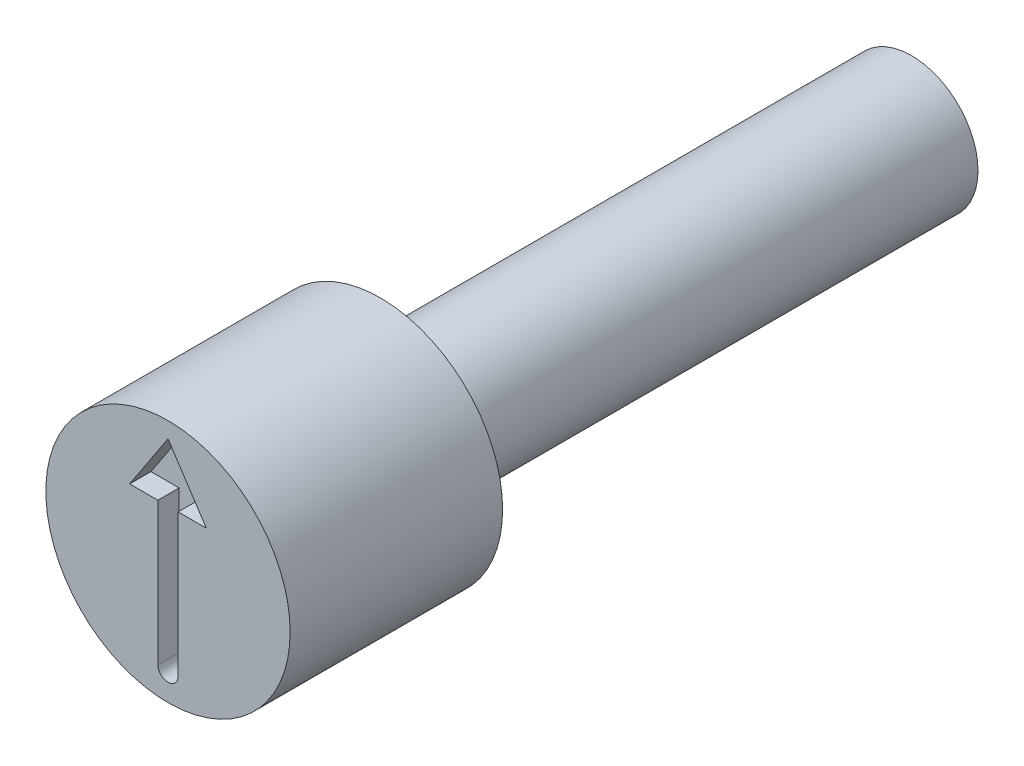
from build123d import *

# Parameters (mm, degrees)
CUT_EXTRUDE4_DEPTH = 0.4


with BuildPart() as part:
    # Sketch2 → Revolve1 (revolve)
    with BuildSketch(Plane(origin=(0, 0, 0), x_dir=(0, 0, -1), z_dir=(1, 0, 0)), mode=Mode.PRIVATE) as revolve1_sk:
        Polygon((0, 2.3), (0, 0), (14, 0), (14, 1.25), (4, 1.25), (4, 2.3), align=None)
    revolve(revolve1_sk.sketch.rotate(Axis((0, 0, -0.403888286), (0, 0, -1)), 90), axis=Axis((0, 0, -0.403888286), (0, 0, -1)))

    # Sketch3 → Cut-Extrude4 (cut)
    with BuildSketch(Plane.XY):
        with BuildLine():
            Line((0.190473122, 0.906351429), (0.190473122, -1.776161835))
            ThreePointArc((0.190473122, -1.776161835), (0, -1.966634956), (-0.190473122, -1.776161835))
            Line((-0.190473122, -1.776161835), (-0.190473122, 0.906351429))
            Line((-0.190473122, 0.906351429), (-0.721917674, 0.906351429))
            Line((-0.721917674, 0.906351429), (0, 2.002115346))
            Line((0, 2.002115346), (0.721917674, 0.906351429))
            Line((0.721917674, 0.906351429), (0.190473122, 0.906351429))
        make_face()
    extrude(amount=-CUT_EXTRUDE4_DEPTH, mode=Mode.SUBTRACT)


solid = part.part
